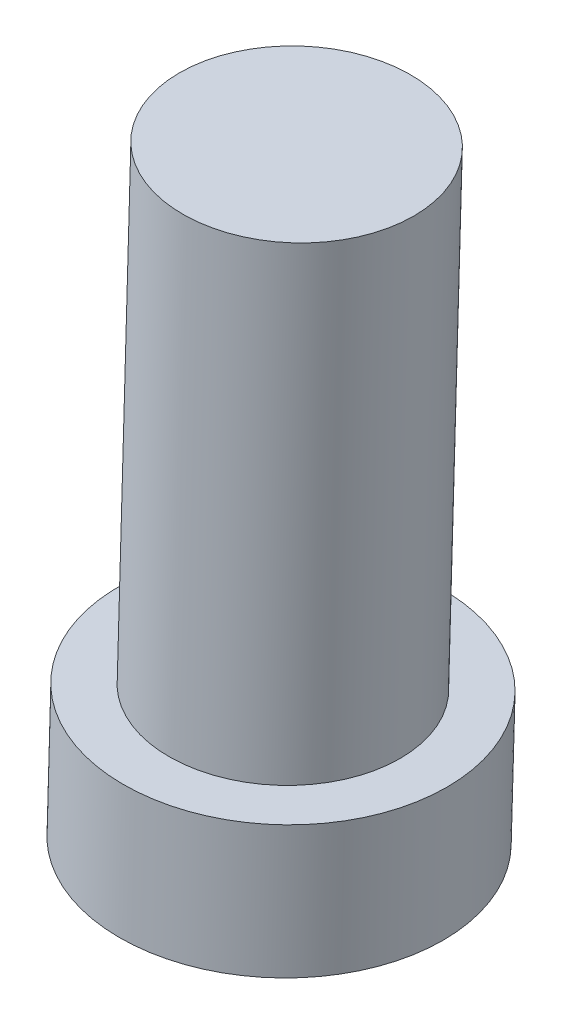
ISO-10303-21;
HEADER;
FILE_DESCRIPTION(('STEP AP214'),'2;1');
FILE_NAME('part.step','',(''),(''),'','','');
FILE_SCHEMA(('AUTOMOTIVE_DESIGN { 1 0 10303 214 1 1 1 1 }'));
ENDSEC;
DATA;
#1=APPLICATION_CONTEXT('core data for automotive mechanical design processes');
#2=APPLICATION_PROTOCOL_DEFINITION('international standard','automotive_design',2000,#1);
#3=PRODUCT_CONTEXT('',#1,'mechanical');
#4=PRODUCT('Part','Part','',(#3));
#5=PRODUCT_RELATED_PRODUCT_CATEGORY('part','',(#4));
#6=PRODUCT_DEFINITION_FORMATION('','',#4);
#7=PRODUCT_DEFINITION_CONTEXT('part definition',#1,'design');
#8=PRODUCT_DEFINITION('design','',#6,#7);
#9=PRODUCT_DEFINITION_SHAPE('','',#8);
#10=(LENGTH_UNIT() NAMED_UNIT(*) SI_UNIT(.MILLI.,.METRE.));
#11=(NAMED_UNIT(*) PLANE_ANGLE_UNIT() SI_UNIT($,.RADIAN.));
#12=(NAMED_UNIT(*) SI_UNIT($,.STERADIAN.) SOLID_ANGLE_UNIT());
#13=UNCERTAINTY_MEASURE_WITH_UNIT(LENGTH_MEASURE(1.E-05),#10,'distance_accuracy_value','');
#14=(GEOMETRIC_REPRESENTATION_CONTEXT(3) GLOBAL_UNCERTAINTY_ASSIGNED_CONTEXT((#13)) GLOBAL_UNIT_ASSIGNED_CONTEXT((#10,
#11,#12)) REPRESENTATION_CONTEXT('',''));
#15=CARTESIAN_POINT('',(0.,0.,0.));
#16=DIRECTION('',(0.,0.,1.));
#17=DIRECTION('',(1.,0.,0.));
#18=AXIS2_PLACEMENT_3D('',#15,#16,#17);
#19=CARTESIAN_POINT('',(-192.603180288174,45.0812248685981,-216.567475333));
#20=DIRECTION('',(-0.0287732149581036,-0.999585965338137,0.));
#21=DIRECTION('',(0.999585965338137,-0.0287732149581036,0.));
#22=AXIS2_PLACEMENT_3D('',#19,#20,#21);
#23=CYLINDRICAL_SURFACE('',#22,10.);
#24=CARTESIAN_POINT('',(-192.613797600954,44.7123777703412,-216.567475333));
#25=DIRECTION('',(-0.0287732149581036,-0.999585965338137,0.));
#26=DIRECTION('',(0.999585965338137,-0.0287732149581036,0.));
#27=AXIS2_PLACEMENT_3D('',#24,#25,#26);
#28=CIRCLE('',#27,10.);
#29=CARTESIAN_POINT('',(-182.617937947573,44.4246456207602,-216.567475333));
#30=VERTEX_POINT('',#29);
#31=EDGE_CURVE('E10',#30,#30,#28,.T.);
#32=ORIENTED_EDGE('',*,*,#31,.T.);
#33=EDGE_LOOP('',(#32));
#34=FACE_BOUND('',#33,.T.);
#35=CARTESIAN_POINT('',(-193.783578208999,4.07401740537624,-216.567475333));
#36=DIRECTION('',(-0.0287732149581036,-0.999585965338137,0.));
#37=DIRECTION('',(0.999585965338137,-0.0287732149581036,0.));
#38=AXIS2_PLACEMENT_3D('',#35,#36,#37);
#39=CIRCLE('',#38,9.99999999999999);
#40=CARTESIAN_POINT('',(-183.787718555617,3.7862852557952,-216.567475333));
#41=VERTEX_POINT('',#40);
#42=EDGE_CURVE('E47',#41,#41,#39,.T.);
#43=ORIENTED_EDGE('',*,*,#42,.F.);
#44=EDGE_LOOP('',(#43));
#45=FACE_BOUND('',#44,.T.);
#46=ADVANCED_FACE('F33',(#34,#45),#23,.T.);
#47=CARTESIAN_POINT('',(-182.617937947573,44.4246456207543,-216.567475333));
#48=DIRECTION('',(0.0287732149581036,0.999585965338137,0.));
#49=DIRECTION('',(-0.999585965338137,0.0287732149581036,0.));
#50=AXIS2_PLACEMENT_3D('',#47,#48,#49);
#51=PLANE('',#50);
#52=ORIENTED_EDGE('',*,*,#31,.F.);
#53=EDGE_LOOP('',(#52));
#54=FACE_BOUND('',#53,.T.);
#55=ADVANCED_FACE('F57',(#54),#51,.T.);
#56=CARTESIAN_POINT('',(-194.113827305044,-7.39888758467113,-216.567475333));
#57=DIRECTION('',(-0.0287732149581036,-0.999585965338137,0.));
#58=DIRECTION('',(0.999585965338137,-0.0287732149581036,0.));
#59=AXIS2_PLACEMENT_3D('',#56,#57,#58);
#60=PLANE('',#59);
#61=CARTESIAN_POINT('',(-194.113827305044,-7.39888758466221,-216.567475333));
#62=DIRECTION('',(-0.0287732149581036,-0.999585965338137,0.));
#63=DIRECTION('',(0.999585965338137,-0.0287732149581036,0.));
#64=AXIS2_PLACEMENT_3D('',#61,#62,#63);
#65=CIRCLE('',#64,14.);
#66=CARTESIAN_POINT('',(-180.11962379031,-7.80171259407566,-216.567475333));
#67=VERTEX_POINT('',#66);
#68=EDGE_CURVE('E39',#67,#67,#65,.T.);
#69=ORIENTED_EDGE('',*,*,#68,.T.);
#70=EDGE_LOOP('',(#69));
#71=FACE_BOUND('',#70,.T.);
#72=ADVANCED_FACE('F61',(#71),#60,.T.);
#73=CARTESIAN_POINT('',(-192.603180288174,45.0812248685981,-216.567475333));
#74=DIRECTION('',(-0.0287732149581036,-0.999585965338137,0.));
#75=DIRECTION('',(0.999585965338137,-0.0287732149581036,0.));
#76=AXIS2_PLACEMENT_3D('',#73,#74,#75);
#77=CYLINDRICAL_SURFACE('',#76,14.0000000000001);
#78=CARTESIAN_POINT('',(-193.783578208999,4.07401740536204,-216.567475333));
#79=DIRECTION('',(-0.0287732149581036,-0.999585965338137,0.));
#80=DIRECTION('',(0.999585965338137,-0.0287732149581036,0.));
#81=AXIS2_PLACEMENT_3D('',#78,#79,#80);
#82=CIRCLE('',#81,14.0000000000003);
#83=CARTESIAN_POINT('',(-179.789374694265,3.67119239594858,-216.567475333));
#84=VERTEX_POINT('',#83);
#85=EDGE_CURVE('E43',#84,#84,#82,.T.);
#86=ORIENTED_EDGE('',*,*,#85,.T.);
#87=EDGE_LOOP('',(#86));
#88=FACE_BOUND('',#87,.T.);
#89=ORIENTED_EDGE('',*,*,#68,.F.);
#90=EDGE_LOOP('',(#89));
#91=FACE_BOUND('',#90,.T.);
#92=ADVANCED_FACE('F66',(#88,#91),#77,.T.);
#93=CARTESIAN_POINT('',(-179.789374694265,3.67119239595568,-216.567475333));
#94=DIRECTION('',(0.0287732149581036,0.999585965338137,0.));
#95=DIRECTION('',(-0.999585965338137,0.0287732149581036,0.));
#96=AXIS2_PLACEMENT_3D('',#93,#94,#95);
#97=PLANE('',#96);
#98=ORIENTED_EDGE('',*,*,#42,.T.);
#99=EDGE_LOOP('',(#98));
#100=FACE_BOUND('',#99,.T.);
#101=ORIENTED_EDGE('',*,*,#85,.F.);
#102=EDGE_LOOP('',(#101));
#103=FACE_BOUND('',#102,.T.);
#104=ADVANCED_FACE('F53',(#100,#103),#97,.T.);
#105=CLOSED_SHELL('',(#46,#55,#72,#92,#104));
#106=MANIFOLD_SOLID_BREP('B2',#105);
#107=ADVANCED_BREP_SHAPE_REPRESENTATION('',(#18,#106),#14);
#108=SHAPE_DEFINITION_REPRESENTATION(#9,#107);
ENDSEC;
END-ISO-10303-21;
